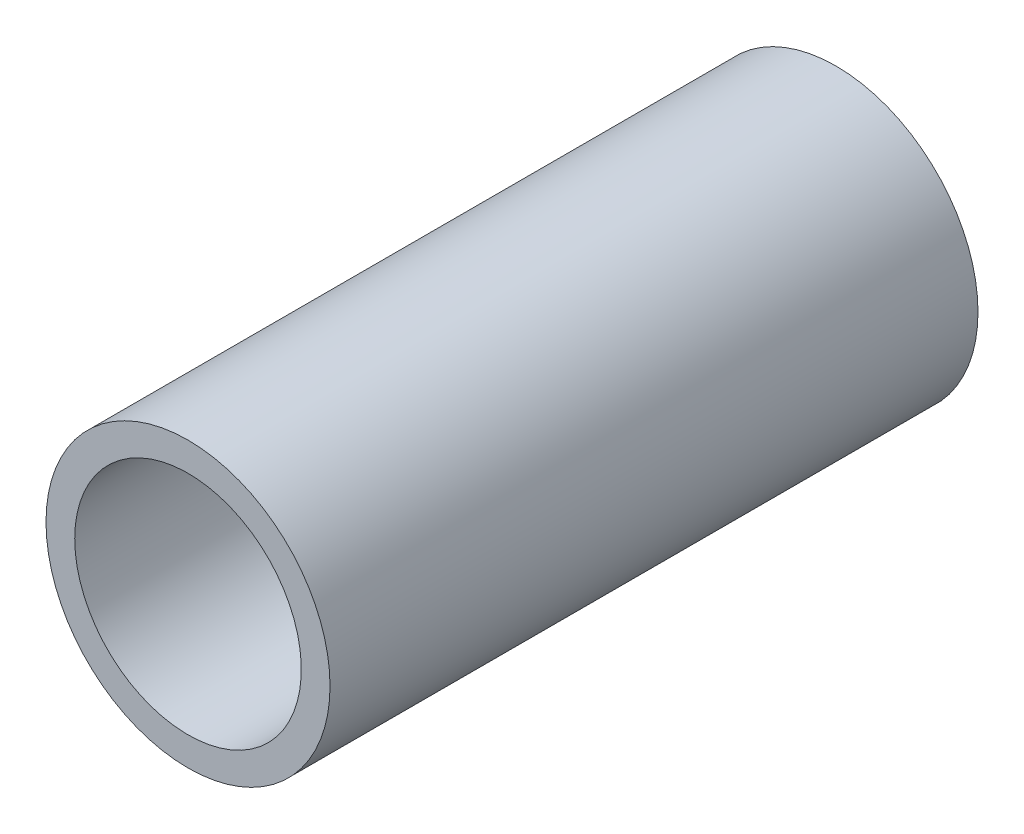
from build123d import *

# Parameters (mm, degrees)
SKETCH1_R      = 16.7005
SKETCH1_R_2    = 13.3223
EXTRUDE1_DEPTH = 76.2


with BuildPart() as part:
    # Sketch1 → Extrude1 (new body)
    with BuildSketch(Plane.XY):
        with Locations(Location((0, 0, 0), (0, 0, 180))):
            Circle(SKETCH1_R)
        with Locations(Location((0, 0, 0), (0, 0, 180))):
            Circle(SKETCH1_R_2, mode=Mode.SUBTRACT)
    extrude(amount=EXTRUDE1_DEPTH)


solid = part.part
